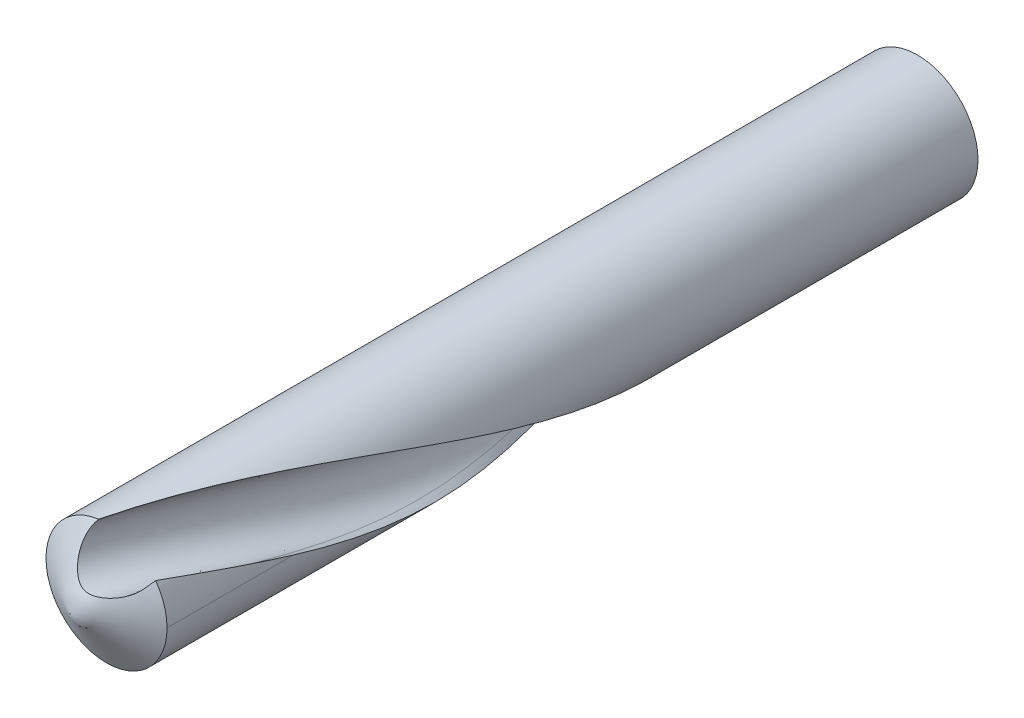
from build123d import *

# Parameters (mm, degrees)
CUT_SWEEP1_PITCH       = 210
CUT_SWEEP1_HEIGHT      = 110
CUT_SWEEP1_RADIUS      = 3
CUT_SWEEP1_START_ANGLE = 90


with BuildPart() as part:
    # Sketch1 → Revolve1 (revolve)
    with BuildSketch(Plane(origin=(0, 0, 0), x_dir=(0, 0, -1), z_dir=(1, 0, 0)), mode=Mode.PRIVATE) as revolve1_sk:
        Polygon((0, 0), (-140, 0), (-133.99139381, 10), (0, 10), align=None)
    revolve(revolve1_sk.sketch.rotate(Axis((0, 0, 0), (0, 0, -1)), 270), axis=Axis((0, 0, 0), (0, 0, -1)))

    # Cut-Sweep1: sweep along a helix
    with BuildLine() as cut_sweep1_path:
        add(Helix(CUT_SWEEP1_PITCH, CUT_SWEEP1_HEIGHT, CUT_SWEEP1_RADIUS, center=(0, 0, 140), direction=(0, 0, -1), mode=Mode.PRIVATE).rotate(Axis((0, 0, 140), (0, 0, -1)), CUT_SWEEP1_START_ANGLE))
    # Sketch4 → Cut-Sweep1 (sweep, cut)
    with BuildSketch(Plane(origin=(0, 3, 140), x_dir=(-0.9959957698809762, 0, -0.08940037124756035), z_dir=(0.08940037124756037, 0, -0.9959957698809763))):
        with BuildLine():
            Line((-3.285954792, 24.294083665), (3.047378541, 6.380711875))
            ThreePointArc((3.047378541, 6.380711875), (0, 0), (-6.380711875, 3.047378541))
            Line((-6.380711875, 3.047378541), (-12.714045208, 20.960750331))
            Line((-12.714045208, 20.960750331), (-3.285954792, 24.294083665))
        make_face()
    sweep(path=cut_sweep1_path.line, is_frenet=True, mode=Mode.SUBTRACT)


solid = part.part
